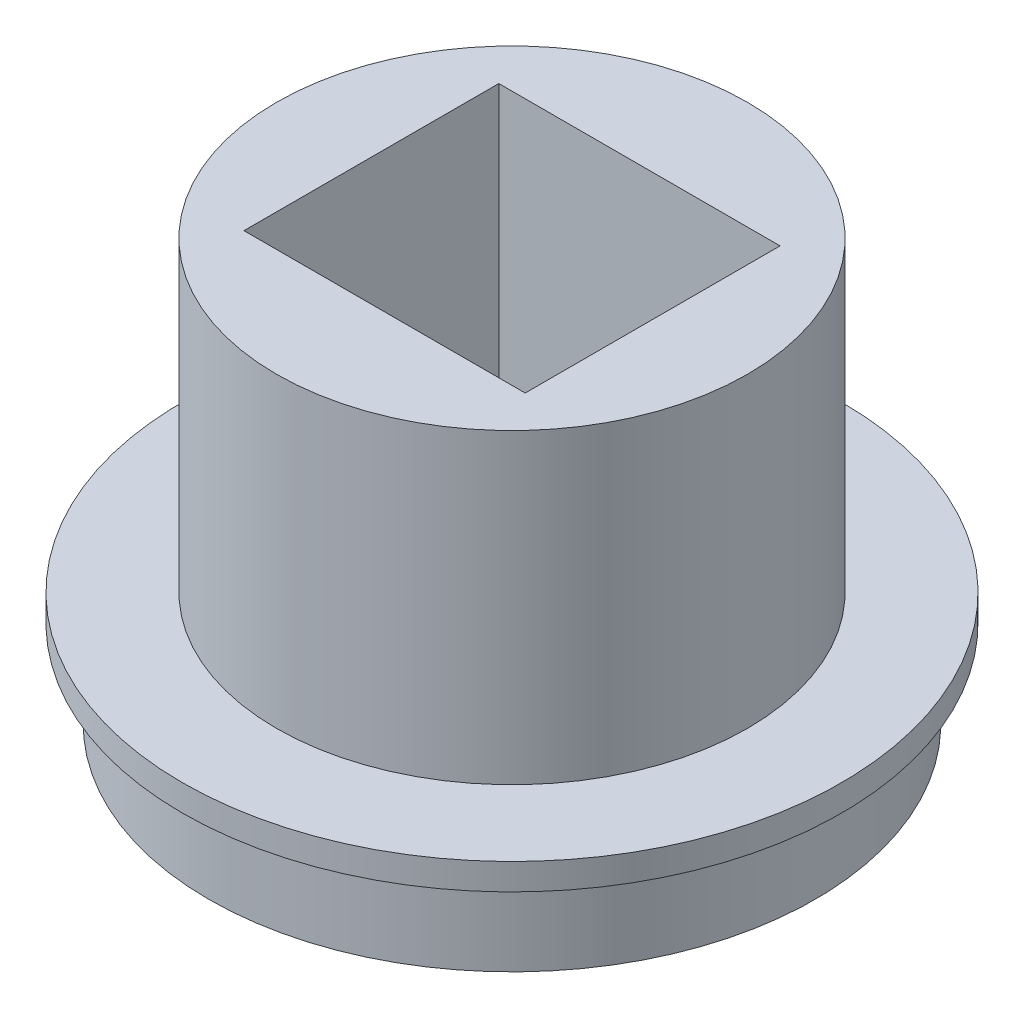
ISO-10303-21;
HEADER;
FILE_DESCRIPTION(('STEP AP214'),'2;1');
FILE_NAME('part.step','',(''),(''),'','','');
FILE_SCHEMA(('AUTOMOTIVE_DESIGN { 1 0 10303 214 1 1 1 1 }'));
ENDSEC;
DATA;
#1=APPLICATION_CONTEXT('core data for automotive mechanical design processes');
#2=APPLICATION_PROTOCOL_DEFINITION('international standard','automotive_design',2000,#1);
#3=PRODUCT_CONTEXT('',#1,'mechanical');
#4=PRODUCT('Part','Part','',(#3));
#5=PRODUCT_RELATED_PRODUCT_CATEGORY('part','',(#4));
#6=PRODUCT_DEFINITION_FORMATION('','',#4);
#7=PRODUCT_DEFINITION_CONTEXT('part definition',#1,'design');
#8=PRODUCT_DEFINITION('design','',#6,#7);
#9=PRODUCT_DEFINITION_SHAPE('','',#8);
#10=(LENGTH_UNIT() NAMED_UNIT(*) SI_UNIT(.MILLI.,.METRE.));
#11=(NAMED_UNIT(*) PLANE_ANGLE_UNIT() SI_UNIT($,.RADIAN.));
#12=(NAMED_UNIT(*) SI_UNIT($,.STERADIAN.) SOLID_ANGLE_UNIT());
#13=UNCERTAINTY_MEASURE_WITH_UNIT(LENGTH_MEASURE(1.E-05),#10,'distance_accuracy_value','');
#14=(GEOMETRIC_REPRESENTATION_CONTEXT(3) GLOBAL_UNCERTAINTY_ASSIGNED_CONTEXT((#13)) GLOBAL_UNIT_ASSIGNED_CONTEXT((#10,
#11,#12)) REPRESENTATION_CONTEXT('',''));
#15=CARTESIAN_POINT('',(0.,0.,0.));
#16=DIRECTION('',(0.,0.,1.));
#17=DIRECTION('',(1.,0.,0.));
#18=AXIS2_PLACEMENT_3D('',#15,#16,#17);
#19=CARTESIAN_POINT('',(0.,5.,0.));
#20=DIRECTION('',(0.,-1.,0.));
#21=DIRECTION('',(0.,0.,-1.));
#22=AXIS2_PLACEMENT_3D('',#19,#20,#21);
#23=CYLINDRICAL_SURFACE('',#22,17.25);
#24=CARTESIAN_POINT('',(0.,0.,0.));
#25=DIRECTION('',(0.,-1.,0.));
#26=DIRECTION('',(0.,0.,-1.));
#27=AXIS2_PLACEMENT_3D('',#24,#25,#26);
#28=CIRCLE('',#27,17.25);
#29=CARTESIAN_POINT('',(0.,0.,-17.25));
#30=VERTEX_POINT('',#29);
#31=EDGE_CURVE('E92',#30,#30,#28,.F.);
#32=ORIENTED_EDGE('',*,*,#31,.T.);
#33=EDGE_LOOP('',(#32));
#34=FACE_BOUND('',#33,.T.);
#35=CARTESIAN_POINT('',(0.,5.,0.));
#36=DIRECTION('',(0.,-1.,0.));
#37=DIRECTION('',(0.,0.,-1.));
#38=AXIS2_PLACEMENT_3D('',#35,#36,#37);
#39=CIRCLE('',#38,17.25);
#40=CARTESIAN_POINT('',(0.,5.,-17.25));
#41=VERTEX_POINT('',#40);
#42=EDGE_CURVE('E20',#41,#41,#39,.F.);
#43=ORIENTED_EDGE('',*,*,#42,.F.);
#44=EDGE_LOOP('',(#43));
#45=FACE_BOUND('',#44,.T.);
#46=ADVANCED_FACE('F17',(#34,#45),#23,.T.);
#47=CARTESIAN_POINT('',(0.,5.,0.));
#48=DIRECTION('',(0.,-1.,0.));
#49=DIRECTION('',(0.,0.,-1.));
#50=AXIS2_PLACEMENT_3D('',#47,#48,#49);
#51=PLANE('',#50);
#52=CARTESIAN_POINT('',(0.,5.,0.));
#53=DIRECTION('',(0.,-1.,0.));
#54=DIRECTION('',(0.,0.,-1.));
#55=AXIS2_PLACEMENT_3D('',#52,#53,#54);
#56=CIRCLE('',#55,18.75);
#57=CARTESIAN_POINT('',(0.,5.,-18.75));
#58=VERTEX_POINT('',#57);
#59=EDGE_CURVE('E73',#58,#58,#56,.F.);
#60=ORIENTED_EDGE('',*,*,#59,.F.);
#61=EDGE_LOOP('',(#60));
#62=FACE_BOUND('',#61,.T.);
#63=ORIENTED_EDGE('',*,*,#42,.T.);
#64=EDGE_LOOP('',(#63));
#65=FACE_BOUND('',#64,.T.);
#66=ADVANCED_FACE('F99',(#62,#65),#51,.T.);
#67=CARTESIAN_POINT('',(0.,0.,0.));
#68=DIRECTION('',(0.,1.,0.));
#69=DIRECTION('',(0.,0.,1.));
#70=AXIS2_PLACEMENT_3D('',#67,#68,#69);
#71=PLANE('',#70);
#72=ORIENTED_EDGE('',*,*,#31,.F.);
#73=EDGE_LOOP('',(#72));
#74=FACE_BOUND('',#73,.T.);
#75=DIRECTION('',(0.,0.,1.));
#76=VECTOR('',#75,1.);
#77=CARTESIAN_POINT('',(-7.99999999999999,0.,-7.24999999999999));
#78=LINE('',#77,#76);
#79=CARTESIAN_POINT('',(-7.99999999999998,0.,-7.25));
#80=VERTEX_POINT('',#79);
#81=CARTESIAN_POINT('',(-7.99999999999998,0.,7.25000000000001));
#82=VERTEX_POINT('',#81);
#83=EDGE_CURVE('E60',#80,#82,#78,.T.);
#84=ORIENTED_EDGE('',*,*,#83,.T.);
#85=DIRECTION('',(1.,0.,0.));
#86=VECTOR('',#85,1.);
#87=CARTESIAN_POINT('',(-7.99999999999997,0.,7.25000000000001));
#88=LINE('',#87,#86);
#89=CARTESIAN_POINT('',(8.00000000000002,0.,7.25000000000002));
#90=VERTEX_POINT('',#89);
#91=EDGE_CURVE('E216',#82,#90,#88,.T.);
#92=ORIENTED_EDGE('',*,*,#91,.T.);
#93=DIRECTION('',(0.,0.,-1.));
#94=VECTOR('',#93,1.);
#95=CARTESIAN_POINT('',(8.00000000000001,0.,-7.24999999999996));
#96=LINE('',#95,#94);
#97=CARTESIAN_POINT('',(8.00000000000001,0.,-7.24999999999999));
#98=VERTEX_POINT('',#97);
#99=EDGE_CURVE('E55',#90,#98,#96,.T.);
#100=ORIENTED_EDGE('',*,*,#99,.T.);
#101=DIRECTION('',(1.,0.,0.));
#102=VECTOR('',#101,1.);
#103=CARTESIAN_POINT('',(-7.99999999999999,0.,-7.24999999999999));
#104=LINE('',#103,#102);
#105=EDGE_CURVE('E57',#98,#80,#104,.F.);
#106=ORIENTED_EDGE('',*,*,#105,.T.);
#107=EDGE_LOOP('',(#84,#92,#100,#106));
#108=FACE_BOUND('',#107,.T.);
#109=ADVANCED_FACE('F59',(#74,#108),#71,.F.);
#110=CARTESIAN_POINT('',(0.,23.95,0.));
#111=DIRECTION('',(0.,-1.,0.));
#112=DIRECTION('',(0.,0.,-1.));
#113=AXIS2_PLACEMENT_3D('',#110,#111,#112);
#114=CYLINDRICAL_SURFACE('',#113,18.75);
#115=ORIENTED_EDGE('',*,*,#59,.T.);
#116=EDGE_LOOP('',(#115));
#117=FACE_BOUND('',#116,.T.);
#118=CARTESIAN_POINT('',(0.,6.50000000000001,0.));
#119=DIRECTION('',(0.,-1.,0.));
#120=DIRECTION('',(0.,0.,-1.));
#121=AXIS2_PLACEMENT_3D('',#118,#119,#120);
#122=CIRCLE('',#121,18.75);
#123=CARTESIAN_POINT('',(0.,6.50000000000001,-18.75));
#124=VERTEX_POINT('',#123);
#125=EDGE_CURVE('E87',#124,#124,#122,.F.);
#126=ORIENTED_EDGE('',*,*,#125,.F.);
#127=EDGE_LOOP('',(#126));
#128=FACE_BOUND('',#127,.T.);
#129=ADVANCED_FACE('F134',(#117,#128),#114,.T.);
#130=CARTESIAN_POINT('',(-7.99999999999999,0.,-7.24999999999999));
#131=DIRECTION('',(-1.,0.,0.));
#132=DIRECTION('',(0.,0.,1.));
#133=AXIS2_PLACEMENT_3D('',#130,#131,#132);
#134=PLANE('',#133);
#135=DIRECTION('',(0.,-1.,0.));
#136=VECTOR('',#135,1.);
#137=CARTESIAN_POINT('',(-7.99999999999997,0.,7.25000000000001));
#138=LINE('',#137,#136);
#139=CARTESIAN_POINT('',(-7.99999999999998,23.95,7.25000000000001));
#140=VERTEX_POINT('',#139);
#141=EDGE_CURVE('E71',#140,#82,#138,.T.);
#142=ORIENTED_EDGE('',*,*,#141,.T.);
#143=ORIENTED_EDGE('',*,*,#83,.F.);
#144=DIRECTION('',(0.,1.,0.));
#145=VECTOR('',#144,1.);
#146=CARTESIAN_POINT('',(-7.99999999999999,0.,-7.24999999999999));
#147=LINE('',#146,#145);
#148=CARTESIAN_POINT('',(-7.99999999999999,23.95,-7.25));
#149=VERTEX_POINT('',#148);
#150=EDGE_CURVE('E65',#80,#149,#147,.T.);
#151=ORIENTED_EDGE('',*,*,#150,.T.);
#152=DIRECTION('',(0.,0.,1.));
#153=VECTOR('',#152,1.);
#154=CARTESIAN_POINT('',(-7.99999999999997,23.95,0.));
#155=LINE('',#154,#153);
#156=EDGE_CURVE('E90',#140,#149,#155,.F.);
#157=ORIENTED_EDGE('',*,*,#156,.F.);
#158=EDGE_LOOP('',(#142,#143,#151,#157));
#159=FACE_BOUND('',#158,.T.);
#160=ADVANCED_FACE('F68',(#159),#134,.F.);
#161=CARTESIAN_POINT('',(-7.99999999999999,0.,-7.24999999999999));
#162=DIRECTION('',(0.,0.,-1.));
#163=DIRECTION('',(0.,1.,0.));
#164=AXIS2_PLACEMENT_3D('',#161,#162,#163);
#165=PLANE('',#164);
#166=ORIENTED_EDGE('',*,*,#150,.F.);
#167=ORIENTED_EDGE('',*,*,#105,.F.);
#168=DIRECTION('',(0.,1.,0.));
#169=VECTOR('',#168,1.);
#170=CARTESIAN_POINT('',(8.00000000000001,0.,-7.24999999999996));
#171=LINE('',#170,#169);
#172=CARTESIAN_POINT('',(8.00000000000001,23.95,-7.24999999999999));
#173=VERTEX_POINT('',#172);
#174=EDGE_CURVE('E80',#98,#173,#171,.T.);
#175=ORIENTED_EDGE('',*,*,#174,.T.);
#176=DIRECTION('',(1.,0.,0.));
#177=VECTOR('',#176,1.);
#178=CARTESIAN_POINT('',(0.,23.95,-7.25000000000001));
#179=LINE('',#178,#177);
#180=EDGE_CURVE('E77',#149,#173,#179,.T.);
#181=ORIENTED_EDGE('',*,*,#180,.F.);
#182=EDGE_LOOP('',(#166,#167,#175,#181));
#183=FACE_BOUND('',#182,.T.);
#184=ADVANCED_FACE('F75',(#183),#165,.F.);
#185=CARTESIAN_POINT('',(8.00000000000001,0.,-7.24999999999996));
#186=DIRECTION('',(1.,0.,0.));
#187=DIRECTION('',(0.,0.,-1.));
#188=AXIS2_PLACEMENT_3D('',#185,#186,#187);
#189=PLANE('',#188);
#190=ORIENTED_EDGE('',*,*,#174,.F.);
#191=ORIENTED_EDGE('',*,*,#99,.F.);
#192=DIRECTION('',(0.,-1.,0.));
#193=VECTOR('',#192,1.);
#194=CARTESIAN_POINT('',(8.00000000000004,0.,7.25000000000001));
#195=LINE('',#194,#193);
#196=CARTESIAN_POINT('',(8.00000000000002,23.95,7.25000000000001));
#197=VERTEX_POINT('',#196);
#198=EDGE_CURVE('E35',#90,#197,#195,.F.);
#199=ORIENTED_EDGE('',*,*,#198,.T.);
#200=DIRECTION('',(0.,0.,1.));
#201=VECTOR('',#200,1.);
#202=CARTESIAN_POINT('',(8.00000000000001,23.95,0.));
#203=LINE('',#202,#201);
#204=EDGE_CURVE('E215',#173,#197,#203,.T.);
#205=ORIENTED_EDGE('',*,*,#204,.F.);
#206=EDGE_LOOP('',(#190,#191,#199,#205));
#207=FACE_BOUND('',#206,.T.);
#208=ADVANCED_FACE('F126',(#207),#189,.F.);
#209=CARTESIAN_POINT('',(-7.99999999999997,0.,7.25000000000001));
#210=DIRECTION('',(0.,0.,1.));
#211=DIRECTION('',(0.,-1.,0.));
#212=AXIS2_PLACEMENT_3D('',#209,#210,#211);
#213=PLANE('',#212);
#214=ORIENTED_EDGE('',*,*,#198,.F.);
#215=ORIENTED_EDGE('',*,*,#91,.F.);
#216=ORIENTED_EDGE('',*,*,#141,.F.);
#217=DIRECTION('',(1.,0.,0.));
#218=VECTOR('',#217,1.);
#219=CARTESIAN_POINT('',(0.,23.95,7.25000000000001));
#220=LINE('',#219,#218);
#221=EDGE_CURVE('E86',#197,#140,#220,.F.);
#222=ORIENTED_EDGE('',*,*,#221,.F.);
#223=EDGE_LOOP('',(#214,#215,#216,#222));
#224=FACE_BOUND('',#223,.T.);
#225=ADVANCED_FACE('F122',(#224),#213,.F.);
#226=CARTESIAN_POINT('',(0.,6.50000000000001,0.));
#227=DIRECTION('',(0.,1.,0.));
#228=DIRECTION('',(0.,0.,1.));
#229=AXIS2_PLACEMENT_3D('',#226,#227,#228);
#230=PLANE('',#229);
#231=ORIENTED_EDGE('',*,*,#125,.T.);
#232=EDGE_LOOP('',(#231));
#233=FACE_BOUND('',#232,.T.);
#234=CARTESIAN_POINT('',(0.,6.50000000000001,0.));
#235=DIRECTION('',(0.,1.,0.));
#236=DIRECTION('',(0.,0.,1.));
#237=AXIS2_PLACEMENT_3D('',#234,#235,#236);
#238=CIRCLE('',#237,13.4);
#239=CARTESIAN_POINT('',(0.,6.50000000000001,13.4));
#240=VERTEX_POINT('',#239);
#241=EDGE_CURVE('E26',#240,#240,#238,.T.);
#242=ORIENTED_EDGE('',*,*,#241,.F.);
#243=EDGE_LOOP('',(#242));
#244=FACE_BOUND('',#243,.T.);
#245=ADVANCED_FACE('F115',(#233,#244),#230,.T.);
#246=CARTESIAN_POINT('',(0.,23.95,0.));
#247=DIRECTION('',(0.,1.,0.));
#248=DIRECTION('',(0.,0.,1.));
#249=AXIS2_PLACEMENT_3D('',#246,#247,#248);
#250=PLANE('',#249);
#251=CARTESIAN_POINT('',(0.,23.95,0.));
#252=DIRECTION('',(0.,1.,0.));
#253=DIRECTION('',(0.,0.,1.));
#254=AXIS2_PLACEMENT_3D('',#251,#252,#253);
#255=CIRCLE('',#254,13.4);
#256=CARTESIAN_POINT('',(0.,23.95,13.4));
#257=VERTEX_POINT('',#256);
#258=EDGE_CURVE('E11',#257,#257,#255,.F.);
#259=ORIENTED_EDGE('',*,*,#258,.F.);
#260=EDGE_LOOP('',(#259));
#261=FACE_BOUND('',#260,.T.);
#262=ORIENTED_EDGE('',*,*,#204,.T.);
#263=ORIENTED_EDGE('',*,*,#221,.T.);
#264=ORIENTED_EDGE('',*,*,#156,.T.);
#265=ORIENTED_EDGE('',*,*,#180,.T.);
#266=EDGE_LOOP('',(#262,#263,#264,#265));
#267=FACE_BOUND('',#266,.T.);
#268=ADVANCED_FACE('F109',(#261,#267),#250,.T.);
#269=CARTESIAN_POINT('',(0.,6.50000000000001,0.));
#270=DIRECTION('',(0.,1.,0.));
#271=DIRECTION('',(0.,0.,1.));
#272=AXIS2_PLACEMENT_3D('',#269,#270,#271);
#273=CYLINDRICAL_SURFACE('',#272,13.4);
#274=ORIENTED_EDGE('',*,*,#258,.T.);
#275=EDGE_LOOP('',(#274));
#276=FACE_BOUND('',#275,.T.);
#277=ORIENTED_EDGE('',*,*,#241,.T.);
#278=EDGE_LOOP('',(#277));
#279=FACE_BOUND('',#278,.T.);
#280=ADVANCED_FACE('F107',(#276,#279),#273,.T.);
#281=CLOSED_SHELL('',(#46,#66,#109,#129,#160,#184,#208,#225,#245,#268,#280));
#282=MANIFOLD_SOLID_BREP('B1',#281);
#283=ADVANCED_BREP_SHAPE_REPRESENTATION('',(#18,#282),#14);
#284=SHAPE_DEFINITION_REPRESENTATION(#9,#283);
ENDSEC;
END-ISO-10303-21;
